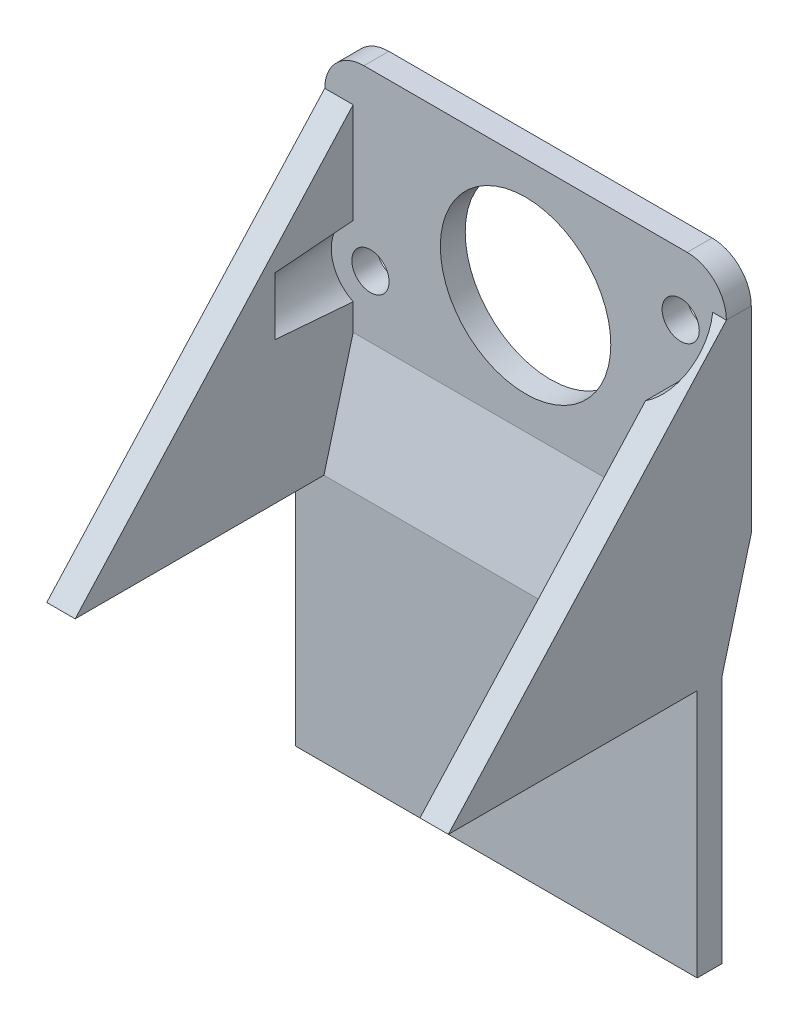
ISO-10303-21;
HEADER;
FILE_DESCRIPTION(('STEP AP214'),'2;1');
FILE_NAME('part.step','',(''),(''),'','','');
FILE_SCHEMA(('AUTOMOTIVE_DESIGN { 1 0 10303 214 1 1 1 1 }'));
ENDSEC;
DATA;
#1=APPLICATION_CONTEXT('core data for automotive mechanical design processes');
#2=APPLICATION_PROTOCOL_DEFINITION('international standard','automotive_design',2000,#1);
#3=PRODUCT_CONTEXT('',#1,'mechanical');
#4=PRODUCT('Part','Part','',(#3));
#5=PRODUCT_RELATED_PRODUCT_CATEGORY('part','',(#4));
#6=PRODUCT_DEFINITION_FORMATION('','',#4);
#7=PRODUCT_DEFINITION_CONTEXT('part definition',#1,'design');
#8=PRODUCT_DEFINITION('design','',#6,#7);
#9=PRODUCT_DEFINITION_SHAPE('','',#8);
#10=(LENGTH_UNIT() NAMED_UNIT(*) SI_UNIT(.MILLI.,.METRE.));
#11=(NAMED_UNIT(*) PLANE_ANGLE_UNIT() SI_UNIT($,.RADIAN.));
#12=(NAMED_UNIT(*) SI_UNIT($,.STERADIAN.) SOLID_ANGLE_UNIT());
#13=UNCERTAINTY_MEASURE_WITH_UNIT(LENGTH_MEASURE(1.E-05),#10,'distance_accuracy_value','');
#14=(GEOMETRIC_REPRESENTATION_CONTEXT(3) GLOBAL_UNCERTAINTY_ASSIGNED_CONTEXT((#13)) GLOBAL_UNIT_ASSIGNED_CONTEXT((#10,
#11,#12)) REPRESENTATION_CONTEXT('',''));
#15=CARTESIAN_POINT('',(0.,0.,0.));
#16=DIRECTION('',(0.,0.,1.));
#17=DIRECTION('',(1.,0.,0.));
#18=AXIS2_PLACEMENT_3D('',#15,#16,#17);
#19=CARTESIAN_POINT('',(-44.,0.,0.));
#20=DIRECTION('',(-1.,0.,0.));
#21=DIRECTION('',(0.,0.,1.));
#22=AXIS2_PLACEMENT_3D('',#19,#20,#21);
#23=PLANE('',#22);
#24=CARTESIAN_POINT('',(-44.,-19.3448213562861,54.6344712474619));
#25=CARTESIAN_POINT('',(-44.,-19.441196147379,53.6070138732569));
#26=CARTESIAN_POINT('',(-44.,-19.5363539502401,52.5794432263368));
#27=CARTESIAN_POINT('',(-44.,-19.7245603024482,50.5241100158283));
#28=CARTESIAN_POINT('',(-44.,-19.817608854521,49.4963474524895));
#29=CARTESIAN_POINT('',(-44.,-20.0940765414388,46.4128370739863));
#30=CARTESIAN_POINT('',(-44.,-20.2748193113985,44.356849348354));
#31=CARTESIAN_POINT('',(-44.,-20.6309239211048,40.2443890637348));
#32=CARTESIAN_POINT('',(-44.,-20.8062857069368,38.187916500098));
#33=CARTESIAN_POINT('',(-44.,-21.1528041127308,34.0746167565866));
#34=CARTESIAN_POINT('',(-44.,-21.3239607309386,32.0177895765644));
#35=CARTESIAN_POINT('',(-44.,-21.6629157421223,27.9038542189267));
#36=CARTESIAN_POINT('',(-44.,-21.8307141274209,25.8467460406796));
#37=CARTESIAN_POINT('',(-44.,-22.1635689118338,21.7323076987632));
#38=CARTESIAN_POINT('',(-44.,-22.3286253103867,19.6749775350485));
#39=CARTESIAN_POINT('',(-44.,-22.8204188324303,13.5026631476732));
#40=CARTESIAN_POINT('',(-44.,-23.1437758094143,9.38740965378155));
#41=CARTESIAN_POINT('',(-44.,-23.7840959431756,1.15641187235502));
#42=CARTESIAN_POINT('',(-44.,-24.1010591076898,-2.95933241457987));
#43=CARTESIAN_POINT('',(-44.,-24.6049101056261,-9.55168985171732));
#44=CARTESIAN_POINT('',(-44.,-24.7933193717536,-12.0281868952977));
#45=CARTESIAN_POINT('',(-44.,-25.1686559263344,-16.9812642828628));
#46=CARTESIAN_POINT('',(-44.,-25.3555832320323,-19.4578446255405));
#47=CARTESIAN_POINT('',(-44.,-25.5418940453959,-21.9344712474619));
#48=B_SPLINE_CURVE_WITH_KNOTS('',3,(#24,#25,#26,#27,#28,#29,#30,#31,#32,#33,#34,#35,#36,#37,#38,
#39,#40,#41,#42,#43,#44,#45,#46,#47),.UNSPECIFIED.,.F.,.F.,(4,2,2,2,2,2,2,2,2,2,2,4),(0.,
3.09590020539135,6.19179640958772,12.3835369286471,18.5753394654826,24.7671445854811,
30.9589638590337,37.1507844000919,49.5345899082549,61.9183804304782,69.3693410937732,
76.8202149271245),.UNSPECIFIED.);
#49=CARTESIAN_POINT('',(-44.,-21.7892646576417,26.35));
#50=VERTEX_POINT('',#49);
#51=CARTESIAN_POINT('',(-44.,-23.379990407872,6.35));
#52=VERTEX_POINT('',#51);
#53=EDGE_CURVE('E11',#50,#52,#48,.T.);
#54=ORIENTED_EDGE('',*,*,#53,.F.);
#55=DIRECTION('',(0.,1.,0.));
#56=VECTOR('',#55,1.);
#57=CARTESIAN_POINT('',(-44.,0.,26.35));
#58=LINE('',#57,#56);
#59=CARTESIAN_POINT('',(-44.,-7.02593241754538,26.35));
#60=VERTEX_POINT('',#59);
#61=EDGE_CURVE('E225',#50,#60,#58,.T.);
#62=ORIENTED_EDGE('',*,*,#61,.T.);
#63=CARTESIAN_POINT('',(-44.,-3.27330302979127,-21.9344712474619));
#64=CARTESIAN_POINT('',(-44.,-3.41328984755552,-20.0735885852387));
#65=CARTESIAN_POINT('',(-44.,-3.55362808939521,-18.2127323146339));
#66=CARTESIAN_POINT('',(-44.,-3.83510652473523,-14.4910824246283));
#67=CARTESIAN_POINT('',(-44.,-3.97624671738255,-12.630288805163));
#68=CARTESIAN_POINT('',(-44.,-4.25942751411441,-8.90878249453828));
#69=CARTESIAN_POINT('',(-44.,-4.4014681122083,-7.04806980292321));
#70=CARTESIAN_POINT('',(-44.,-4.68657362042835,-3.32672087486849));
#71=CARTESIAN_POINT('',(-44.,-4.82963853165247,-1.46608463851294));
#72=CARTESIAN_POINT('',(-44.,-5.14785299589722,2.65553022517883));
#73=CARTESIAN_POINT('',(-44.,-5.32328115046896,4.91648735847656));
#74=CARTESIAN_POINT('',(-44.,-5.67618536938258,9.43824168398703));
#75=CARTESIAN_POINT('',(-44.,-5.85366143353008,11.6990388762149));
#76=CARTESIAN_POINT('',(-44.,-6.2110751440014,16.2204318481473));
#77=CARTESIAN_POINT('',(-44.,-6.39101278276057,18.4810276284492));
#78=CARTESIAN_POINT('',(-44.,-6.75389127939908,23.0019796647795));
#79=CARTESIAN_POINT('',(-44.,-6.93683213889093,25.2623359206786));
#80=CARTESIAN_POINT('',(-44.,-7.30644801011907,29.7827852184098));
#81=CARTESIAN_POINT('',(-44.,-7.49312309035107,32.0428782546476));
#82=CARTESIAN_POINT('',(-44.,-7.87120034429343,36.5626667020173));
#83=CARTESIAN_POINT('',(-44.,-8.06260251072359,38.8223621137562));
#84=CARTESIAN_POINT('',(-44.,-8.35434771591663,42.2115195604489));
#85=CARTESIAN_POINT('',(-44.,-8.45237039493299,43.3411813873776));
#86=CARTESIAN_POINT('',(-44.,-8.65021678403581,45.6003469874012));
#87=CARTESIAN_POINT('',(-44.,-8.75004049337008,46.7298507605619));
#88=CARTESIAN_POINT('',(-44.,-8.95178559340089,48.988677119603));
#89=CARTESIAN_POINT('',(-44.,-9.05370699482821,50.1179997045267));
#90=CARTESIAN_POINT('',(-44.,-9.26005775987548,52.3764172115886));
#91=CARTESIAN_POINT('',(-44.,-9.36448712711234,53.5055121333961));
#92=CARTESIAN_POINT('',(-44.,-9.47037571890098,54.6344712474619));
#93=B_SPLINE_CURVE_WITH_KNOTS('',3,(#63,#64,#65,#66,#67,#68,#69,#70,#71,#72,#73,#74,#75,#76,#77,
#78,#79,#80,#81,#82,#83,#84,#85,#86,#87,#88,#89,#90,#91,#92),.UNSPECIFIED.,.F.,.F.,(4,2,2,2,2,2,
2,2,2,2,2,2,2,2,4),(0.,5.59842171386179,11.1968374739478,16.7952160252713,22.3936005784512,
29.1968578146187,36.0001144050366,42.8033500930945,49.6065894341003,56.4099536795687,
63.2133074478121,66.6150262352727,70.0167436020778,73.4184783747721,76.8202180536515),.UNSPECIFIED.);
#94=CARTESIAN_POINT('',(-44.,-5.43520666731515,6.35));
#95=VERTEX_POINT('',#94);
#96=EDGE_CURVE('E61',#95,#60,#93,.T.);
#97=ORIENTED_EDGE('',*,*,#96,.F.);
#98=DIRECTION('',(0.,1.,0.));
#99=VECTOR('',#98,1.);
#100=CARTESIAN_POINT('',(-44.,30.1625,6.35));
#101=LINE('',#100,#99);
#102=CARTESIAN_POINT('',(-44.,20.1625,6.35));
#103=VERTEX_POINT('',#102);
#104=EDGE_CURVE('E223',#95,#103,#101,.T.);
#105=ORIENTED_EDGE('',*,*,#104,.T.);
#106=DIRECTION('',(0.,0.74044352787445,-0.672118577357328));
#107=VECTOR('',#106,1.);
#108=CARTESIAN_POINT('',(-44.,-58.,77.3));
#109=LINE('',#108,#107);
#110=CARTESIAN_POINT('',(-44.,-58.,77.3));
#111=VERTEX_POINT('',#110);
#112=EDGE_CURVE('E474',#111,#103,#109,.T.);
#113=ORIENTED_EDGE('',*,*,#112,.F.);
#114=DIRECTION('',(0.,0.,-1.));
#115=VECTOR('',#114,1.);
#116=CARTESIAN_POINT('',(-44.,-58.,13.7999999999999));
#117=LINE('',#116,#115);
#118=CARTESIAN_POINT('',(-44.,-58.,13.7999999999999));
#119=VERTEX_POINT('',#118);
#120=EDGE_CURVE('E238',#111,#119,#117,.T.);
#121=ORIENTED_EDGE('',*,*,#120,.T.);
#122=DIRECTION('',(0.,0.96600416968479,-0.258526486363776));
#123=VECTOR('',#122,1.);
#124=CARTESIAN_POINT('',(-44.,-30.1625,6.35));
#125=LINE('',#124,#123);
#126=CARTESIAN_POINT('',(-44.,-30.1625,6.35));
#127=VERTEX_POINT('',#126);
#128=EDGE_CURVE('E246',#119,#127,#125,.T.);
#129=ORIENTED_EDGE('',*,*,#128,.T.);
#130=EDGE_CURVE('E233',#127,#52,#101,.T.);
#131=ORIENTED_EDGE('',*,*,#130,.T.);
#132=EDGE_LOOP('',(#54,#62,#97,#105,#113,#121,#129,#131));
#133=FACE_BOUND('',#132,.T.);
#134=ADVANCED_FACE('F46',(#133),#23,.F.);
#135=CARTESIAN_POINT('',(44.,0.,0.));
#136=DIRECTION('',(-1.,0.,0.));
#137=DIRECTION('',(0.,0.,1.));
#138=AXIS2_PLACEMENT_3D('',#135,#136,#137);
#139=PLANE('',#138);
#140=DIRECTION('',(0.,0.74044352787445,-0.672118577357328));
#141=VECTOR('',#140,1.);
#142=CARTESIAN_POINT('',(44.,-58.,77.3));
#143=LINE('',#142,#141);
#144=CARTESIAN_POINT('',(44.,-58.,77.3));
#145=VERTEX_POINT('',#144);
#146=CARTESIAN_POINT('',(44.,5.43520666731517,19.7183219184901));
#147=VERTEX_POINT('',#146);
#148=EDGE_CURVE('E471',#145,#147,#143,.T.);
#149=ORIENTED_EDGE('',*,*,#148,.T.);
#150=DIRECTION('',(0.,0.,-1.));
#151=VECTOR('',#150,1.);
#152=CARTESIAN_POINT('',(44.,5.43520666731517,44.8155460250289));
#153=LINE('',#152,#151);
#154=CARTESIAN_POINT('',(44.,5.43520666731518,6.35));
#155=VERTEX_POINT('',#154);
#156=EDGE_CURVE('E477',#147,#155,#153,.T.);
#157=ORIENTED_EDGE('',*,*,#156,.T.);
#158=DIRECTION('',(0.,1.,0.));
#159=VECTOR('',#158,1.);
#160=CARTESIAN_POINT('',(44.,30.1625,6.35));
#161=LINE('',#160,#159);
#162=CARTESIAN_POINT('',(44.,-30.1625,6.35));
#163=VERTEX_POINT('',#162);
#164=EDGE_CURVE('E251',#163,#155,#161,.T.);
#165=ORIENTED_EDGE('',*,*,#164,.F.);
#166=DIRECTION('',(0.,0.96600416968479,-0.258526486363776));
#167=VECTOR('',#166,1.);
#168=CARTESIAN_POINT('',(44.,-30.1625,6.35));
#169=LINE('',#168,#167);
#170=CARTESIAN_POINT('',(44.,-58.,13.7999999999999));
#171=VERTEX_POINT('',#170);
#172=EDGE_CURVE('E234',#171,#163,#169,.T.);
#173=ORIENTED_EDGE('',*,*,#172,.F.);
#174=DIRECTION('',(0.,0.,-1.));
#175=VECTOR('',#174,1.);
#176=CARTESIAN_POINT('',(44.,-58.,13.7999999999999));
#177=LINE('',#176,#175);
#178=EDGE_CURVE('E76',#145,#171,#177,.T.);
#179=ORIENTED_EDGE('',*,*,#178,.F.);
#180=EDGE_LOOP('',(#149,#157,#165,#173,#179));
#181=FACE_BOUND('',#180,.T.);
#182=ADVANCED_FACE('F503',(#181),#139,.T.);
#183=CARTESIAN_POINT('',(51.25,-58.,77.3));
#184=DIRECTION('',(0.,1.,0.));
#185=DIRECTION('',(0.,0.,1.));
#186=AXIS2_PLACEMENT_3D('',#183,#184,#185);
#187=PLANE('',#186);
#188=ORIENTED_EDGE('',*,*,#178,.T.);
#189=DIRECTION('',(-1.,0.,0.));
#190=VECTOR('',#189,1.);
#191=CARTESIAN_POINT('',(51.25,-58.,13.7999999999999));
#192=LINE('',#191,#190);
#193=CARTESIAN_POINT('',(51.25,-58.,13.7999999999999));
#194=VERTEX_POINT('',#193);
#195=EDGE_CURVE('E403',#194,#171,#192,.T.);
#196=ORIENTED_EDGE('',*,*,#195,.F.);
#197=DIRECTION('',(0.,0.,-1.));
#198=VECTOR('',#197,1.);
#199=CARTESIAN_POINT('',(51.25,-58.,77.3));
#200=LINE('',#199,#198);
#201=CARTESIAN_POINT('',(51.25,-58.,77.3));
#202=VERTEX_POINT('',#201);
#203=EDGE_CURVE('E267',#202,#194,#200,.T.);
#204=ORIENTED_EDGE('',*,*,#203,.F.);
#205=DIRECTION('',(-1.,0.,0.));
#206=VECTOR('',#205,1.);
#207=CARTESIAN_POINT('',(51.25,-58.,77.3));
#208=LINE('',#207,#206);
#209=EDGE_CURVE('E278',#202,#145,#208,.T.);
#210=ORIENTED_EDGE('',*,*,#209,.T.);
#211=EDGE_LOOP('',(#188,#196,#204,#210));
#212=FACE_BOUND('',#211,.T.);
#213=ADVANCED_FACE('F507',(#212),#187,.F.);
#214=CARTESIAN_POINT('',(51.25,-58.,77.3));
#215=DIRECTION('',(0.,-0.672118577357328,-0.74044352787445));
#216=DIRECTION('',(0.,0.74044352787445,-0.672118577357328));
#217=AXIS2_PLACEMENT_3D('',#214,#215,#216);
#218=PLANE('',#217);
#219=CARTESIAN_POINT('',(39.5845516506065,14.4075985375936,11.5738638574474));
#220=DIRECTION('',(0.,-0.672118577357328,-0.74044352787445));
#221=DIRECTION('',(0.,0.74044352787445,-0.672118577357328));
#222=AXIS2_PLACEMENT_3D('',#219,#220,#221);
#223=ELLIPSE('',#222,13.5054188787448,10.);
#224=CARTESIAN_POINT('',(47.7626387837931,20.1625,6.35));
#225=VERTEX_POINT('',#224);
#226=EDGE_CURVE('E255',#225,#147,#223,.T.);
#227=ORIENTED_EDGE('',*,*,#226,.T.);
#228=ORIENTED_EDGE('',*,*,#148,.F.);
#229=ORIENTED_EDGE('',*,*,#209,.F.);
#230=DIRECTION('',(0.,-0.74044352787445,0.672118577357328));
#231=VECTOR('',#230,1.);
#232=CARTESIAN_POINT('',(51.25,-58.,77.3));
#233=LINE('',#232,#231);
#234=CARTESIAN_POINT('',(51.25,20.1625,6.35));
#235=VERTEX_POINT('',#234);
#236=EDGE_CURVE('E264',#235,#202,#233,.T.);
#237=ORIENTED_EDGE('',*,*,#236,.F.);
#238=DIRECTION('',(-1.,0.,0.));
#239=VECTOR('',#238,1.);
#240=CARTESIAN_POINT('',(51.25,20.1625,6.35));
#241=LINE('',#240,#239);
#242=EDGE_CURVE('E282',#235,#225,#241,.T.);
#243=ORIENTED_EDGE('',*,*,#242,.T.);
#244=EDGE_LOOP('',(#227,#228,#229,#237,#243));
#245=FACE_BOUND('',#244,.T.);
#246=ADVANCED_FACE('F511',(#245),#218,.F.);
#247=CARTESIAN_POINT('',(0.,0.,6.35));
#248=DIRECTION('',(0.,0.,1.));
#249=DIRECTION('',(1.,0.,0.));
#250=AXIS2_PLACEMENT_3D('',#247,#248,#249);
#251=PLANE('',#250);
#252=CARTESIAN_POINT('',(39.5845516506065,14.4075985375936,6.35));
#253=DIRECTION('',(0.,0.,1.));
#254=DIRECTION('',(1.,0.,0.));
#255=AXIS2_PLACEMENT_3D('',#252,#253,#254);
#256=CIRCLE('',#255,4.75);
#257=CARTESIAN_POINT('',(44.3345516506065,14.4075985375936,6.35));
#258=VERTEX_POINT('',#257);
#259=EDGE_CURVE('E290',#258,#258,#256,.T.);
#260=ORIENTED_EDGE('',*,*,#259,.F.);
#261=EDGE_LOOP('',(#260));
#262=FACE_BOUND('',#261,.T.);
#263=ORIENTED_EDGE('',*,*,#104,.F.);
#264=CARTESIAN_POINT('',(-39.5845516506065,-14.4075985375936,6.35));
#265=DIRECTION('',(0.,0.,1.));
#266=DIRECTION('',(1.,0.,0.));
#267=AXIS2_PLACEMENT_3D('',#264,#265,#266);
#268=CIRCLE('',#267,10.);
#269=EDGE_CURVE('E208',#95,#52,#268,.T.);
#270=ORIENTED_EDGE('',*,*,#269,.T.);
#271=ORIENTED_EDGE('',*,*,#130,.F.);
#272=DIRECTION('',(1.,0.,0.));
#273=VECTOR('',#272,1.);
#274=CARTESIAN_POINT('',(-44.,-30.1625,6.35));
#275=LINE('',#274,#273);
#276=EDGE_CURVE('E258',#127,#163,#275,.T.);
#277=ORIENTED_EDGE('',*,*,#276,.T.);
#278=ORIENTED_EDGE('',*,*,#164,.T.);
#279=CARTESIAN_POINT('',(39.5845516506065,14.4075985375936,6.35));
#280=DIRECTION('',(0.,0.,1.));
#281=DIRECTION('',(1.,0.,0.));
#282=AXIS2_PLACEMENT_3D('',#279,#280,#281);
#283=CIRCLE('',#282,10.);
#284=EDGE_CURVE('E68',#155,#225,#283,.T.);
#285=ORIENTED_EDGE('',*,*,#284,.T.);
#286=ORIENTED_EDGE('',*,*,#242,.F.);
#287=CARTESIAN_POINT('',(41.25,20.1625,6.35));
#288=DIRECTION('',(0.,0.,1.));
#289=DIRECTION('',(1.,0.,0.));
#290=AXIS2_PLACEMENT_3D('',#287,#288,#289);
#291=CIRCLE('',#290,10.);
#292=CARTESIAN_POINT('',(41.25,30.1625,6.35));
#293=VERTEX_POINT('',#292);
#294=EDGE_CURVE('E461',#235,#293,#291,.T.);
#295=ORIENTED_EDGE('',*,*,#294,.T.);
#296=DIRECTION('',(-1.,0.,0.));
#297=VECTOR('',#296,1.);
#298=CARTESIAN_POINT('',(-51.25,30.1625,6.35));
#299=LINE('',#298,#297);
#300=CARTESIAN_POINT('',(-41.25,30.1625,6.35));
#301=VERTEX_POINT('',#300);
#302=EDGE_CURVE('E424',#293,#301,#299,.T.);
#303=ORIENTED_EDGE('',*,*,#302,.T.);
#304=CARTESIAN_POINT('',(-41.25,20.1625,6.35));
#305=DIRECTION('',(0.,0.,1.));
#306=DIRECTION('',(1.,0.,0.));
#307=AXIS2_PLACEMENT_3D('',#304,#305,#306);
#308=CIRCLE('',#307,10.);
#309=CARTESIAN_POINT('',(-51.25,20.1625,6.35));
#310=VERTEX_POINT('',#309);
#311=EDGE_CURVE('E464',#301,#310,#308,.T.);
#312=ORIENTED_EDGE('',*,*,#311,.T.);
#313=EDGE_CURVE('E231',#103,#310,#241,.T.);
#314=ORIENTED_EDGE('',*,*,#313,.F.);
#315=EDGE_LOOP('',(#263,#270,#271,#277,#278,#285,#286,#295,#303,#312,#314));
#316=FACE_BOUND('',#315,.T.);
#317=CARTESIAN_POINT('',(0.,0.,6.35));
#318=DIRECTION('',(0.,0.,1.));
#319=DIRECTION('',(1.,0.,0.));
#320=AXIS2_PLACEMENT_3D('',#317,#318,#319);
#321=CIRCLE('',#320,21.75);
#322=CARTESIAN_POINT('',(21.75,0.,6.35));
#323=VERTEX_POINT('',#322);
#324=EDGE_CURVE('E416',#323,#323,#321,.T.);
#325=ORIENTED_EDGE('',*,*,#324,.F.);
#326=EDGE_LOOP('',(#325));
#327=FACE_BOUND('',#326,.T.);
#328=CARTESIAN_POINT('',(-39.5845516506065,-14.4075985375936,6.35));
#329=DIRECTION('',(0.,0.,1.));
#330=DIRECTION('',(1.,0.,0.));
#331=AXIS2_PLACEMENT_3D('',#328,#329,#330);
#332=CIRCLE('',#331,4.75);
#333=CARTESIAN_POINT('',(-34.8345516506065,-14.4075985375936,6.35));
#334=VERTEX_POINT('',#333);
#335=EDGE_CURVE('E286',#334,#334,#332,.T.);
#336=ORIENTED_EDGE('',*,*,#335,.F.);
#337=EDGE_LOOP('',(#336));
#338=FACE_BOUND('',#337,.T.);
#339=ADVANCED_FACE('F228',(#262,#316,#327,#338),#251,.T.);
#340=CARTESIAN_POINT('',(40.,-121.5,7.44999999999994));
#341=DIRECTION('',(0.,0.0812956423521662,0.996690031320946));
#342=DIRECTION('',(0.,-0.996690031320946,0.0812956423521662));
#343=AXIS2_PLACEMENT_3D('',#340,#341,#342);
#344=PLANE('',#343);
#345=DIRECTION('',(0.,-0.996690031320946,0.0812956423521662));
#346=VECTOR('',#345,1.);
#347=CARTESIAN_POINT('',(32.5,-121.5,7.44999999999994));
#348=LINE('',#347,#346);
#349=CARTESIAN_POINT('',(32.5,-30.1625,0.));
#350=VERTEX_POINT('',#349);
#351=CARTESIAN_POINT('',(32.5,-121.5,7.44999999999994));
#352=VERTEX_POINT('',#351);
#353=EDGE_CURVE('E304',#350,#352,#348,.T.);
#354=ORIENTED_EDGE('',*,*,#353,.F.);
#355=DIRECTION('',(-1.,0.,0.));
#356=VECTOR('',#355,1.);
#357=CARTESIAN_POINT('',(40.,-30.1625,0.));
#358=LINE('',#357,#356);
#359=CARTESIAN_POINT('',(40.,-30.1625,0.));
#360=VERTEX_POINT('',#359);
#361=EDGE_CURVE('E351',#360,#350,#358,.T.);
#362=ORIENTED_EDGE('',*,*,#361,.F.);
#363=DIRECTION('',(0.,0.996690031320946,-0.0812956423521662));
#364=VECTOR('',#363,1.);
#365=CARTESIAN_POINT('',(40.,-121.5,7.44999999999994));
#366=LINE('',#365,#364);
#367=CARTESIAN_POINT('',(40.,-121.5,7.44999999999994));
#368=VERTEX_POINT('',#367);
#369=EDGE_CURVE('E333',#368,#360,#366,.T.);
#370=ORIENTED_EDGE('',*,*,#369,.F.);
#371=DIRECTION('',(-1.,0.,0.));
#372=VECTOR('',#371,1.);
#373=CARTESIAN_POINT('',(40.,-121.5,7.44999999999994));
#374=LINE('',#373,#372);
#375=EDGE_CURVE('E356',#368,#352,#374,.T.);
#376=ORIENTED_EDGE('',*,*,#375,.T.);
#377=EDGE_LOOP('',(#354,#362,#370,#376));
#378=FACE_BOUND('',#377,.T.);
#379=ADVANCED_FACE('F550',(#378),#344,.F.);
#380=CARTESIAN_POINT('',(51.25,-58.,7.44999999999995));
#381=DIRECTION('',(0.,0.,1.));
#382=DIRECTION('',(0.,-1.,0.));
#383=AXIS2_PLACEMENT_3D('',#380,#381,#382);
#384=PLANE('',#383);
#385=DIRECTION('',(0.,-1.,0.));
#386=VECTOR('',#385,1.);
#387=CARTESIAN_POINT('',(40.,-58.,7.44999999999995));
#388=LINE('',#387,#386);
#389=CARTESIAN_POINT('',(40.,-58.,7.44999999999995));
#390=VERTEX_POINT('',#389);
#391=EDGE_CURVE('E329',#390,#368,#388,.T.);
#392=ORIENTED_EDGE('',*,*,#391,.F.);
#393=DIRECTION('',(-1.,0.,0.));
#394=VECTOR('',#393,1.);
#395=CARTESIAN_POINT('',(51.25,-58.,7.44999999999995));
#396=LINE('',#395,#394);
#397=CARTESIAN_POINT('',(51.25,-58.,7.44999999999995));
#398=VERTEX_POINT('',#397);
#399=EDGE_CURVE('E389',#398,#390,#396,.T.);
#400=ORIENTED_EDGE('',*,*,#399,.F.);
#401=DIRECTION('',(0.,1.,0.));
#402=VECTOR('',#401,1.);
#403=CARTESIAN_POINT('',(51.25,-58.,7.44999999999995));
#404=LINE('',#403,#402);
#405=CARTESIAN_POINT('',(51.25,-121.5,7.44999999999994));
#406=VERTEX_POINT('',#405);
#407=EDGE_CURVE('E368',#406,#398,#404,.T.);
#408=ORIENTED_EDGE('',*,*,#407,.F.);
#409=DIRECTION('',(-1.,0.,0.));
#410=VECTOR('',#409,1.);
#411=CARTESIAN_POINT('',(51.25,-121.5,7.44999999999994));
#412=LINE('',#411,#410);
#413=EDGE_CURVE('E394',#406,#368,#412,.T.);
#414=ORIENTED_EDGE('',*,*,#413,.T.);
#415=EDGE_LOOP('',(#392,#400,#408,#414));
#416=FACE_BOUND('',#415,.T.);
#417=ADVANCED_FACE('F560',(#416),#384,.F.);
#418=CARTESIAN_POINT('',(51.25,-30.1625,0.));
#419=DIRECTION('',(0.,0.258526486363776,0.96600416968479));
#420=DIRECTION('',(0.,-0.96600416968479,0.258526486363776));
#421=AXIS2_PLACEMENT_3D('',#418,#419,#420);
#422=PLANE('',#421);
#423=DIRECTION('',(0.,-0.96600416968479,0.258526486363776));
#424=VECTOR('',#423,1.);
#425=CARTESIAN_POINT('',(40.,-30.1625,0.));
#426=LINE('',#425,#424);
#427=EDGE_CURVE('E337',#360,#390,#426,.T.);
#428=ORIENTED_EDGE('',*,*,#427,.F.);
#429=DIRECTION('',(1.,0.,0.));
#430=VECTOR('',#429,1.);
#431=CARTESIAN_POINT('',(-51.25,-30.1625,0.));
#432=LINE('',#431,#430);
#433=CARTESIAN_POINT('',(51.25,-30.1625,0.));
#434=VERTEX_POINT('',#433);
#435=EDGE_CURVE('E437',#360,#434,#432,.T.);
#436=ORIENTED_EDGE('',*,*,#435,.T.);
#437=DIRECTION('',(0.,0.96600416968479,-0.258526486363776));
#438=VECTOR('',#437,1.);
#439=CARTESIAN_POINT('',(51.25,-30.1625,0.));
#440=LINE('',#439,#438);
#441=EDGE_CURVE('E371',#398,#434,#440,.T.);
#442=ORIENTED_EDGE('',*,*,#441,.F.);
#443=ORIENTED_EDGE('',*,*,#399,.T.);
#444=EDGE_LOOP('',(#428,#436,#442,#443));
#445=FACE_BOUND('',#444,.T.);
#446=ADVANCED_FACE('F555',(#445),#422,.F.);
#447=CARTESIAN_POINT('',(0.,0.,0.));
#448=DIRECTION('',(0.,0.,1.));
#449=DIRECTION('',(1.,0.,0.));
#450=AXIS2_PLACEMENT_3D('',#447,#448,#449);
#451=PLANE('',#450);
#452=CARTESIAN_POINT('',(-39.5845516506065,-14.4075985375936,0.));
#453=DIRECTION('',(0.,0.,1.));
#454=DIRECTION('',(1.,0.,0.));
#455=AXIS2_PLACEMENT_3D('',#452,#453,#454);
#456=CIRCLE('',#455,4.75);
#457=CARTESIAN_POINT('',(-34.8345516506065,-14.4075985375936,0.));
#458=VERTEX_POINT('',#457);
#459=EDGE_CURVE('E408',#458,#458,#456,.T.);
#460=ORIENTED_EDGE('',*,*,#459,.T.);
#461=EDGE_LOOP('',(#460));
#462=FACE_BOUND('',#461,.T.);
#463=CARTESIAN_POINT('',(39.5845516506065,14.4075985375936,0.));
#464=DIRECTION('',(0.,0.,1.));
#465=DIRECTION('',(1.,0.,0.));
#466=AXIS2_PLACEMENT_3D('',#463,#464,#465);
#467=CIRCLE('',#466,4.75);
#468=CARTESIAN_POINT('',(44.3345516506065,14.4075985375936,0.));
#469=VERTEX_POINT('',#468);
#470=EDGE_CURVE('E407',#469,#469,#467,.T.);
#471=ORIENTED_EDGE('',*,*,#470,.T.);
#472=EDGE_LOOP('',(#471));
#473=FACE_BOUND('',#472,.T.);
#474=DIRECTION('',(0.,-1.,0.));
#475=VECTOR('',#474,1.);
#476=CARTESIAN_POINT('',(-51.25,-30.1625,0.));
#477=LINE('',#476,#475);
#478=CARTESIAN_POINT('',(-51.25,20.1625,0.));
#479=VERTEX_POINT('',#478);
#480=CARTESIAN_POINT('',(-51.25,-30.1625,0.));
#481=VERTEX_POINT('',#480);
#482=EDGE_CURVE('E433',#479,#481,#477,.T.);
#483=ORIENTED_EDGE('',*,*,#482,.F.);
#484=CARTESIAN_POINT('',(-41.25,20.1625,0.));
#485=DIRECTION('',(0.,0.,1.));
#486=DIRECTION('',(1.,0.,0.));
#487=AXIS2_PLACEMENT_3D('',#484,#485,#486);
#488=CIRCLE('',#487,10.);
#489=CARTESIAN_POINT('',(-41.25,30.1625,0.));
#490=VERTEX_POINT('',#489);
#491=EDGE_CURVE('E451',#479,#490,#488,.F.);
#492=ORIENTED_EDGE('',*,*,#491,.T.);
#493=DIRECTION('',(-1.,0.,0.));
#494=VECTOR('',#493,1.);
#495=CARTESIAN_POINT('',(-51.25,30.1625,0.));
#496=LINE('',#495,#494);
#497=CARTESIAN_POINT('',(41.25,30.1625,0.));
#498=VERTEX_POINT('',#497);
#499=EDGE_CURVE('E420',#498,#490,#496,.T.);
#500=ORIENTED_EDGE('',*,*,#499,.F.);
#501=CARTESIAN_POINT('',(41.25,20.1625,0.));
#502=DIRECTION('',(0.,0.,1.));
#503=DIRECTION('',(1.,0.,0.));
#504=AXIS2_PLACEMENT_3D('',#501,#502,#503);
#505=CIRCLE('',#504,10.);
#506=CARTESIAN_POINT('',(51.25,20.1625,0.));
#507=VERTEX_POINT('',#506);
#508=EDGE_CURVE('E448',#498,#507,#505,.F.);
#509=ORIENTED_EDGE('',*,*,#508,.T.);
#510=DIRECTION('',(0.,1.,0.));
#511=VECTOR('',#510,1.);
#512=CARTESIAN_POINT('',(51.25,-30.1625,0.));
#513=LINE('',#512,#511);
#514=EDGE_CURVE('E429',#434,#507,#513,.T.);
#515=ORIENTED_EDGE('',*,*,#514,.F.);
#516=ORIENTED_EDGE('',*,*,#435,.F.);
#517=ORIENTED_EDGE('',*,*,#361,.T.);
#518=DIRECTION('',(-1.,0.,0.));
#519=VECTOR('',#518,1.);
#520=CARTESIAN_POINT('',(32.5,-30.1625,0.));
#521=LINE('',#520,#519);
#522=CARTESIAN_POINT('',(-32.5,-30.1625,0.));
#523=VERTEX_POINT('',#522);
#524=EDGE_CURVE('E323',#350,#523,#521,.T.);
#525=ORIENTED_EDGE('',*,*,#524,.T.);
#526=CARTESIAN_POINT('',(-40.,-30.1625,0.));
#527=VERTEX_POINT('',#526);
#528=EDGE_CURVE('E340',#523,#527,#358,.T.);
#529=ORIENTED_EDGE('',*,*,#528,.T.);
#530=EDGE_CURVE('E438',#481,#527,#432,.T.);
#531=ORIENTED_EDGE('',*,*,#530,.F.);
#532=EDGE_LOOP('',(#483,#492,#500,#509,#515,#516,#517,#525,#529,#531));
#533=FACE_BOUND('',#532,.T.);
#534=CARTESIAN_POINT('',(0.,0.,0.));
#535=DIRECTION('',(0.,0.,1.));
#536=DIRECTION('',(1.,0.,0.));
#537=AXIS2_PLACEMENT_3D('',#534,#535,#536);
#538=CIRCLE('',#537,21.75);
#539=CARTESIAN_POINT('',(21.75,0.,0.));
#540=VERTEX_POINT('',#539);
#541=EDGE_CURVE('E412',#540,#540,#538,.T.);
#542=ORIENTED_EDGE('',*,*,#541,.T.);
#543=EDGE_LOOP('',(#542));
#544=FACE_BOUND('',#543,.T.);
#545=ADVANCED_FACE('F585',(#462,#473,#533,#544),#451,.F.);
#546=CARTESIAN_POINT('',(-51.25,30.1625,6.35));
#547=DIRECTION('',(0.,-1.,0.));
#548=DIRECTION('',(0.,0.,-1.));
#549=AXIS2_PLACEMENT_3D('',#546,#547,#548);
#550=PLANE('',#549);
#551=ORIENTED_EDGE('',*,*,#499,.T.);
#552=DIRECTION('',(0.,0.,-1.));
#553=VECTOR('',#552,1.);
#554=CARTESIAN_POINT('',(-41.25,30.1625,6.35));
#555=LINE('',#554,#553);
#556=EDGE_CURVE('E458',#490,#301,#555,.F.);
#557=ORIENTED_EDGE('',*,*,#556,.T.);
#558=ORIENTED_EDGE('',*,*,#302,.F.);
#559=DIRECTION('',(0.,0.,-1.));
#560=VECTOR('',#559,1.);
#561=CARTESIAN_POINT('',(41.25,30.1625,6.35));
#562=LINE('',#561,#560);
#563=EDGE_CURVE('E454',#293,#498,#562,.T.);
#564=ORIENTED_EDGE('',*,*,#563,.T.);
#565=EDGE_LOOP('',(#551,#557,#558,#564));
#566=FACE_BOUND('',#565,.T.);
#567=ADVANCED_FACE('F588',(#566),#550,.F.);
#568=CARTESIAN_POINT('',(-51.25,-30.1625,6.35));
#569=DIRECTION('',(1.,0.,0.));
#570=DIRECTION('',(0.,0.,-1.));
#571=AXIS2_PLACEMENT_3D('',#568,#569,#570);
#572=PLANE('',#571);
#573=DIRECTION('',(0.,-0.74044352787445,0.672118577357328));
#574=VECTOR('',#573,1.);
#575=CARTESIAN_POINT('',(-51.25,-58.,77.3));
#576=LINE('',#575,#574);
#577=CARTESIAN_POINT('',(-51.25,-58.,77.3));
#578=VERTEX_POINT('',#577);
#579=EDGE_CURVE('E261',#310,#578,#576,.T.);
#580=ORIENTED_EDGE('',*,*,#579,.F.);
#581=DIRECTION('',(0.,0.,-1.));
#582=VECTOR('',#581,1.);
#583=CARTESIAN_POINT('',(-51.25,20.1625,6.35));
#584=LINE('',#583,#582);
#585=EDGE_CURVE('E428',#310,#479,#584,.T.);
#586=ORIENTED_EDGE('',*,*,#585,.T.);
#587=ORIENTED_EDGE('',*,*,#482,.T.);
#588=DIRECTION('',(0.,0.96600416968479,-0.258526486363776));
#589=VECTOR('',#588,1.);
#590=CARTESIAN_POINT('',(-51.25,-30.1625,0.));
#591=LINE('',#590,#589);
#592=CARTESIAN_POINT('',(-51.25,-58.,7.44999999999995));
#593=VERTEX_POINT('',#592);
#594=EDGE_CURVE('E365',#593,#481,#591,.T.);
#595=ORIENTED_EDGE('',*,*,#594,.F.);
#596=DIRECTION('',(0.,1.,0.));
#597=VECTOR('',#596,1.);
#598=CARTESIAN_POINT('',(-51.25,-58.,7.44999999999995));
#599=LINE('',#598,#597);
#600=CARTESIAN_POINT('',(-51.25,-121.5,7.44999999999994));
#601=VERTEX_POINT('',#600);
#602=EDGE_CURVE('E382',#601,#593,#599,.T.);
#603=ORIENTED_EDGE('',*,*,#602,.F.);
#604=DIRECTION('',(0.,0.,-1.));
#605=VECTOR('',#604,1.);
#606=CARTESIAN_POINT('',(-51.25,-121.5,7.44999999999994));
#607=LINE('',#606,#605);
#608=CARTESIAN_POINT('',(-51.25,-121.5,13.7999999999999));
#609=VERTEX_POINT('',#608);
#610=EDGE_CURVE('E378',#609,#601,#607,.T.);
#611=ORIENTED_EDGE('',*,*,#610,.F.);
#612=DIRECTION('',(0.,-1.,0.));
#613=VECTOR('',#612,1.);
#614=CARTESIAN_POINT('',(-51.25,-121.5,13.7999999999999));
#615=LINE('',#614,#613);
#616=CARTESIAN_POINT('',(-51.25,-58.,13.7999999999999));
#617=VERTEX_POINT('',#616);
#618=EDGE_CURVE('E360',#617,#609,#615,.T.);
#619=ORIENTED_EDGE('',*,*,#618,.F.);
#620=DIRECTION('',(0.,0.,-1.));
#621=VECTOR('',#620,1.);
#622=CARTESIAN_POINT('',(-51.25,-58.,77.3));
#623=LINE('',#622,#621);
#624=EDGE_CURVE('E268',#578,#617,#623,.T.);
#625=ORIENTED_EDGE('',*,*,#624,.F.);
#626=EDGE_LOOP('',(#580,#586,#587,#595,#603,#611,#619,#625));
#627=FACE_BOUND('',#626,.T.);
#628=ADVANCED_FACE('F592',(#627),#572,.F.);
#629=CARTESIAN_POINT('',(51.25,-30.1625,6.35));
#630=DIRECTION('',(-1.,0.,0.));
#631=DIRECTION('',(0.,0.,1.));
#632=AXIS2_PLACEMENT_3D('',#629,#630,#631);
#633=PLANE('',#632);
#634=DIRECTION('',(0.,0.,-1.));
#635=VECTOR('',#634,1.);
#636=CARTESIAN_POINT('',(51.25,20.1625,6.35));
#637=LINE('',#636,#635);
#638=EDGE_CURVE('E467',#507,#235,#637,.F.);
#639=ORIENTED_EDGE('',*,*,#638,.T.);
#640=ORIENTED_EDGE('',*,*,#236,.T.);
#641=ORIENTED_EDGE('',*,*,#203,.T.);
#642=DIRECTION('',(0.,-1.,0.));
#643=VECTOR('',#642,1.);
#644=CARTESIAN_POINT('',(51.25,-121.5,13.7999999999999));
#645=LINE('',#644,#643);
#646=CARTESIAN_POINT('',(51.25,-121.5,13.7999999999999));
#647=VERTEX_POINT('',#646);
#648=EDGE_CURVE('E361',#194,#647,#645,.T.);
#649=ORIENTED_EDGE('',*,*,#648,.T.);
#650=DIRECTION('',(0.,0.,-1.));
#651=VECTOR('',#650,1.);
#652=CARTESIAN_POINT('',(51.25,-121.5,7.44999999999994));
#653=LINE('',#652,#651);
#654=EDGE_CURVE('E364',#647,#406,#653,.T.);
#655=ORIENTED_EDGE('',*,*,#654,.T.);
#656=ORIENTED_EDGE('',*,*,#407,.T.);
#657=ORIENTED_EDGE('',*,*,#441,.T.);
#658=ORIENTED_EDGE('',*,*,#514,.T.);
#659=EDGE_LOOP('',(#639,#640,#641,#649,#655,#656,#657,#658));
#660=FACE_BOUND('',#659,.T.);
#661=ADVANCED_FACE('F580',(#660),#633,.F.);
#662=CARTESIAN_POINT('',(0.,0.,6.35));
#663=DIRECTION('',(0.,0.,-1.));
#664=DIRECTION('',(-1.,0.,0.));
#665=AXIS2_PLACEMENT_3D('',#662,#663,#664);
#666=CYLINDRICAL_SURFACE('',#665,21.75);
#667=ORIENTED_EDGE('',*,*,#324,.T.);
#668=EDGE_LOOP('',(#667));
#669=FACE_BOUND('',#668,.T.);
#670=ORIENTED_EDGE('',*,*,#541,.F.);
#671=EDGE_LOOP('',(#670));
#672=FACE_BOUND('',#671,.T.);
#673=ADVANCED_FACE('F576',(#669,#672),#666,.F.);
#674=CARTESIAN_POINT('',(-41.25,20.1625,6.35));
#675=DIRECTION('',(0.,0.,-1.));
#676=DIRECTION('',(-1.,0.,0.));
#677=AXIS2_PLACEMENT_3D('',#674,#675,#676);
#678=CYLINDRICAL_SURFACE('',#677,10.);
#679=ORIENTED_EDGE('',*,*,#311,.F.);
#680=ORIENTED_EDGE('',*,*,#556,.F.);
#681=ORIENTED_EDGE('',*,*,#491,.F.);
#682=ORIENTED_EDGE('',*,*,#585,.F.);
#683=EDGE_LOOP('',(#679,#680,#681,#682));
#684=FACE_BOUND('',#683,.T.);
#685=ADVANCED_FACE('F579',(#684),#678,.T.);
#686=CARTESIAN_POINT('',(41.25,20.1625,6.35));
#687=DIRECTION('',(0.,0.,-1.));
#688=DIRECTION('',(-1.,0.,0.));
#689=AXIS2_PLACEMENT_3D('',#686,#687,#688);
#690=CYLINDRICAL_SURFACE('',#689,10.);
#691=ORIENTED_EDGE('',*,*,#294,.F.);
#692=ORIENTED_EDGE('',*,*,#638,.F.);
#693=ORIENTED_EDGE('',*,*,#508,.F.);
#694=ORIENTED_EDGE('',*,*,#563,.F.);
#695=EDGE_LOOP('',(#691,#692,#693,#694));
#696=FACE_BOUND('',#695,.T.);
#697=ADVANCED_FACE('F48',(#696),#690,.T.);
#698=CARTESIAN_POINT('',(39.5845516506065,14.4075985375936,19.7850288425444));
#699=DIRECTION('',(0.,0.,-1.));
#700=DIRECTION('',(-1.,0.,0.));
#701=AXIS2_PLACEMENT_3D('',#698,#699,#700);
#702=CYLINDRICAL_SURFACE('',#701,4.75);
#703=ORIENTED_EDGE('',*,*,#470,.F.);
#704=EDGE_LOOP('',(#703));
#705=FACE_BOUND('',#704,.T.);
#706=ORIENTED_EDGE('',*,*,#259,.T.);
#707=EDGE_LOOP('',(#706));
#708=FACE_BOUND('',#707,.T.);
#709=ADVANCED_FACE('F571',(#705,#708),#702,.F.);
#710=CARTESIAN_POINT('',(-39.5845516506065,-14.4075985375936,19.7850288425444));
#711=DIRECTION('',(0.,0.,-1.));
#712=DIRECTION('',(-1.,0.,0.));
#713=AXIS2_PLACEMENT_3D('',#710,#711,#712);
#714=CYLINDRICAL_SURFACE('',#713,4.75);
#715=ORIENTED_EDGE('',*,*,#459,.F.);
#716=EDGE_LOOP('',(#715));
#717=FACE_BOUND('',#716,.T.);
#718=ORIENTED_EDGE('',*,*,#335,.T.);
#719=EDGE_LOOP('',(#718));
#720=FACE_BOUND('',#719,.T.);
#721=ADVANCED_FACE('F567',(#717,#720),#714,.F.);
#722=CARTESIAN_POINT('',(51.25,-121.5,13.7999999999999));
#723=DIRECTION('',(0.,0.,-1.));
#724=DIRECTION('',(-1.,0.,0.));
#725=AXIS2_PLACEMENT_3D('',#722,#723,#724);
#726=PLANE('',#725);
#727=ORIENTED_EDGE('',*,*,#618,.T.);
#728=DIRECTION('',(-1.,0.,0.));
#729=VECTOR('',#728,1.);
#730=CARTESIAN_POINT('',(51.25,-121.5,13.7999999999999));
#731=LINE('',#730,#729);
#732=EDGE_CURVE('E398',#647,#609,#731,.T.);
#733=ORIENTED_EDGE('',*,*,#732,.F.);
#734=ORIENTED_EDGE('',*,*,#648,.F.);
#735=ORIENTED_EDGE('',*,*,#195,.T.);
#736=DIRECTION('',(1.,0.,0.));
#737=VECTOR('',#736,1.);
#738=CARTESIAN_POINT('',(-44.,-58.,13.7999999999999));
#739=LINE('',#738,#737);
#740=EDGE_CURVE('E250',#119,#171,#739,.T.);
#741=ORIENTED_EDGE('',*,*,#740,.F.);
#742=EDGE_CURVE('E402',#119,#617,#192,.T.);
#743=ORIENTED_EDGE('',*,*,#742,.T.);
#744=EDGE_LOOP('',(#727,#733,#734,#735,#741,#743));
#745=FACE_BOUND('',#744,.T.);
#746=ADVANCED_FACE('F563',(#745),#726,.F.);
#747=CARTESIAN_POINT('',(51.25,-121.5,7.44999999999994));
#748=DIRECTION('',(0.,1.,0.));
#749=DIRECTION('',(0.,0.,1.));
#750=AXIS2_PLACEMENT_3D('',#747,#748,#749);
#751=PLANE('',#750);
#752=ORIENTED_EDGE('',*,*,#610,.T.);
#753=CARTESIAN_POINT('',(-40.,-121.5,7.44999999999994));
#754=VERTEX_POINT('',#753);
#755=EDGE_CURVE('E393',#754,#601,#412,.T.);
#756=ORIENTED_EDGE('',*,*,#755,.F.);
#757=CARTESIAN_POINT('',(-32.5,-121.5,7.44999999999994));
#758=VERTEX_POINT('',#757);
#759=EDGE_CURVE('E355',#758,#754,#374,.T.);
#760=ORIENTED_EDGE('',*,*,#759,.F.);
#761=DIRECTION('',(-1.,0.,0.));
#762=VECTOR('',#761,1.);
#763=CARTESIAN_POINT('',(32.5,-121.5,7.44999999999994));
#764=LINE('',#763,#762);
#765=EDGE_CURVE('E318',#352,#758,#764,.T.);
#766=ORIENTED_EDGE('',*,*,#765,.F.);
#767=ORIENTED_EDGE('',*,*,#375,.F.);
#768=ORIENTED_EDGE('',*,*,#413,.F.);
#769=ORIENTED_EDGE('',*,*,#654,.F.);
#770=ORIENTED_EDGE('',*,*,#732,.T.);
#771=EDGE_LOOP('',(#752,#756,#760,#766,#767,#768,#769,#770));
#772=FACE_BOUND('',#771,.T.);
#773=ADVANCED_FACE('F558',(#772),#751,.F.);
#774=CARTESIAN_POINT('',(-40.,-58.,7.44999999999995));
#775=VERTEX_POINT('',#774);
#776=EDGE_CURVE('E375',#775,#593,#396,.T.);
#777=ORIENTED_EDGE('',*,*,#776,.F.);
#778=DIRECTION('',(0.,-1.,0.));
#779=VECTOR('',#778,1.);
#780=CARTESIAN_POINT('',(-40.,-58.,7.44999999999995));
#781=LINE('',#780,#779);
#782=EDGE_CURVE('E322',#775,#754,#781,.T.);
#783=ORIENTED_EDGE('',*,*,#782,.T.);
#784=ORIENTED_EDGE('',*,*,#755,.T.);
#785=ORIENTED_EDGE('',*,*,#602,.T.);
#786=EDGE_LOOP('',(#777,#783,#784,#785));
#787=FACE_BOUND('',#786,.T.);
#788=ADVANCED_FACE('F553',(#787),#384,.F.);
#789=ORIENTED_EDGE('',*,*,#530,.T.);
#790=DIRECTION('',(0.,-0.96600416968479,0.258526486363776));
#791=VECTOR('',#790,1.);
#792=CARTESIAN_POINT('',(-40.,-30.1625,0.));
#793=LINE('',#792,#791);
#794=EDGE_CURVE('E334',#527,#775,#793,.T.);
#795=ORIENTED_EDGE('',*,*,#794,.T.);
#796=ORIENTED_EDGE('',*,*,#776,.T.);
#797=ORIENTED_EDGE('',*,*,#594,.T.);
#798=EDGE_LOOP('',(#789,#795,#796,#797));
#799=FACE_BOUND('',#798,.T.);
#800=ADVANCED_FACE('F548',(#799),#422,.F.);
#801=ORIENTED_EDGE('',*,*,#528,.F.);
#802=DIRECTION('',(0.,-0.996690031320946,0.0812956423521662));
#803=VECTOR('',#802,1.);
#804=CARTESIAN_POINT('',(-32.5,-121.5,7.44999999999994));
#805=LINE('',#804,#803);
#806=EDGE_CURVE('E300',#523,#758,#805,.T.);
#807=ORIENTED_EDGE('',*,*,#806,.T.);
#808=ORIENTED_EDGE('',*,*,#759,.T.);
#809=DIRECTION('',(0.,0.996690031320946,-0.0812956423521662));
#810=VECTOR('',#809,1.);
#811=CARTESIAN_POINT('',(-40.,-121.5,7.44999999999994));
#812=LINE('',#811,#810);
#813=EDGE_CURVE('E344',#754,#527,#812,.T.);
#814=ORIENTED_EDGE('',*,*,#813,.T.);
#815=EDGE_LOOP('',(#801,#807,#808,#814));
#816=FACE_BOUND('',#815,.T.);
#817=ADVANCED_FACE('F541',(#816),#344,.F.);
#818=CARTESIAN_POINT('',(40.,0.,0.));
#819=DIRECTION('',(-1.,0.,0.));
#820=DIRECTION('',(0.,0.,1.));
#821=AXIS2_PLACEMENT_3D('',#818,#819,#820);
#822=PLANE('',#821);
#823=ORIENTED_EDGE('',*,*,#391,.T.);
#824=ORIENTED_EDGE('',*,*,#369,.T.);
#825=ORIENTED_EDGE('',*,*,#427,.T.);
#826=EDGE_LOOP('',(#823,#824,#825));
#827=FACE_BOUND('',#826,.T.);
#828=ADVANCED_FACE('F538',(#827),#822,.F.);
#829=CARTESIAN_POINT('',(-40.,0.,0.));
#830=DIRECTION('',(-1.,0.,0.));
#831=DIRECTION('',(0.,0.,1.));
#832=AXIS2_PLACEMENT_3D('',#829,#830,#831);
#833=PLANE('',#832);
#834=ORIENTED_EDGE('',*,*,#782,.F.);
#835=ORIENTED_EDGE('',*,*,#794,.F.);
#836=ORIENTED_EDGE('',*,*,#813,.F.);
#837=EDGE_LOOP('',(#834,#835,#836));
#838=FACE_BOUND('',#837,.T.);
#839=ADVANCED_FACE('F536',(#838),#833,.T.);
#840=CARTESIAN_POINT('',(32.5,-58.,7.44999999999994));
#841=DIRECTION('',(0.,0.,1.));
#842=DIRECTION('',(1.,0.,0.));
#843=AXIS2_PLACEMENT_3D('',#840,#841,#842);
#844=PLANE('',#843);
#845=DIRECTION('',(0.,1.,0.));
#846=VECTOR('',#845,1.);
#847=CARTESIAN_POINT('',(-32.5,-58.,7.44999999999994));
#848=LINE('',#847,#846);
#849=CARTESIAN_POINT('',(-32.5,-58.,7.44999999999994));
#850=VERTEX_POINT('',#849);
#851=EDGE_CURVE('E294',#758,#850,#848,.T.);
#852=ORIENTED_EDGE('',*,*,#851,.T.);
#853=DIRECTION('',(-1.,0.,0.));
#854=VECTOR('',#853,1.);
#855=CARTESIAN_POINT('',(32.5,-58.,7.44999999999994));
#856=LINE('',#855,#854);
#857=CARTESIAN_POINT('',(32.5,-58.,7.44999999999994));
#858=VERTEX_POINT('',#857);
#859=EDGE_CURVE('E308',#858,#850,#856,.T.);
#860=ORIENTED_EDGE('',*,*,#859,.F.);
#861=DIRECTION('',(0.,1.,0.));
#862=VECTOR('',#861,1.);
#863=CARTESIAN_POINT('',(32.5,-58.,7.44999999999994));
#864=LINE('',#863,#862);
#865=EDGE_CURVE('E295',#352,#858,#864,.T.);
#866=ORIENTED_EDGE('',*,*,#865,.F.);
#867=ORIENTED_EDGE('',*,*,#765,.T.);
#868=EDGE_LOOP('',(#852,#860,#866,#867));
#869=FACE_BOUND('',#868,.T.);
#870=ADVANCED_FACE('F532',(#869),#844,.F.);
#871=CARTESIAN_POINT('',(32.5,-30.1625,0.));
#872=DIRECTION('',(0.,0.258526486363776,0.96600416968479));
#873=DIRECTION('',(0.,-0.96600416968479,0.258526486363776));
#874=AXIS2_PLACEMENT_3D('',#871,#872,#873);
#875=PLANE('',#874);
#876=DIRECTION('',(0.,0.96600416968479,-0.258526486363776));
#877=VECTOR('',#876,1.);
#878=CARTESIAN_POINT('',(-32.5,-30.1625,0.));
#879=LINE('',#878,#877);
#880=EDGE_CURVE('E312',#850,#523,#879,.T.);
#881=ORIENTED_EDGE('',*,*,#880,.T.);
#882=ORIENTED_EDGE('',*,*,#524,.F.);
#883=DIRECTION('',(0.,0.96600416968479,-0.258526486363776));
#884=VECTOR('',#883,1.);
#885=CARTESIAN_POINT('',(32.5,-30.1625,0.));
#886=LINE('',#885,#884);
#887=EDGE_CURVE('E299',#858,#350,#886,.T.);
#888=ORIENTED_EDGE('',*,*,#887,.F.);
#889=ORIENTED_EDGE('',*,*,#859,.T.);
#890=EDGE_LOOP('',(#881,#882,#888,#889));
#891=FACE_BOUND('',#890,.T.);
#892=ADVANCED_FACE('F525',(#891),#875,.F.);
#893=CARTESIAN_POINT('',(32.5,0.,0.));
#894=DIRECTION('',(-1.,0.,0.));
#895=DIRECTION('',(0.,0.,1.));
#896=AXIS2_PLACEMENT_3D('',#893,#894,#895);
#897=PLANE('',#896);
#898=ORIENTED_EDGE('',*,*,#865,.T.);
#899=ORIENTED_EDGE('',*,*,#887,.T.);
#900=ORIENTED_EDGE('',*,*,#353,.T.);
#901=EDGE_LOOP('',(#898,#899,#900));
#902=FACE_BOUND('',#901,.T.);
#903=ADVANCED_FACE('F522',(#902),#897,.T.);
#904=CARTESIAN_POINT('',(-32.5,0.,0.));
#905=DIRECTION('',(-1.,0.,0.));
#906=DIRECTION('',(0.,0.,1.));
#907=AXIS2_PLACEMENT_3D('',#904,#905,#906);
#908=PLANE('',#907);
#909=ORIENTED_EDGE('',*,*,#851,.F.);
#910=ORIENTED_EDGE('',*,*,#806,.F.);
#911=ORIENTED_EDGE('',*,*,#880,.F.);
#912=EDGE_LOOP('',(#909,#910,#911));
#913=FACE_BOUND('',#912,.T.);
#914=ADVANCED_FACE('F517',(#913),#908,.F.);
#915=ORIENTED_EDGE('',*,*,#742,.F.);
#916=ORIENTED_EDGE('',*,*,#120,.F.);
#917=EDGE_CURVE('E271',#111,#578,#208,.T.);
#918=ORIENTED_EDGE('',*,*,#917,.T.);
#919=ORIENTED_EDGE('',*,*,#624,.T.);
#920=EDGE_LOOP('',(#915,#916,#918,#919));
#921=FACE_BOUND('',#920,.T.);
#922=ADVANCED_FACE('F514',(#921),#187,.F.);
#923=ORIENTED_EDGE('',*,*,#917,.F.);
#924=ORIENTED_EDGE('',*,*,#112,.T.);
#925=ORIENTED_EDGE('',*,*,#313,.T.);
#926=ORIENTED_EDGE('',*,*,#579,.T.);
#927=EDGE_LOOP('',(#923,#924,#925,#926));
#928=FACE_BOUND('',#927,.T.);
#929=ADVANCED_FACE('F499',(#928),#218,.F.);
#930=CARTESIAN_POINT('',(-44.,-30.1625,6.35));
#931=DIRECTION('',(0.,-0.258526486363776,-0.96600416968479));
#932=DIRECTION('',(0.,0.96600416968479,-0.258526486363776));
#933=AXIS2_PLACEMENT_3D('',#930,#931,#932);
#934=PLANE('',#933);
#935=ORIENTED_EDGE('',*,*,#172,.T.);
#936=ORIENTED_EDGE('',*,*,#276,.F.);
#937=ORIENTED_EDGE('',*,*,#128,.F.);
#938=ORIENTED_EDGE('',*,*,#740,.T.);
#939=EDGE_LOOP('',(#935,#936,#937,#938));
#940=FACE_BOUND('',#939,.T.);
#941=ADVANCED_FACE('F495',(#940),#934,.F.);
#942=CARTESIAN_POINT('',(39.5845516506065,14.4075985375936,44.8155460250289));
#943=DIRECTION('',(0.,0.,-1.));
#944=DIRECTION('',(-1.,0.,0.));
#945=AXIS2_PLACEMENT_3D('',#942,#943,#944);
#946=CYLINDRICAL_SURFACE('',#945,10.);
#947=ORIENTED_EDGE('',*,*,#226,.F.);
#948=ORIENTED_EDGE('',*,*,#284,.F.);
#949=ORIENTED_EDGE('',*,*,#156,.F.);
#950=EDGE_LOOP('',(#947,#948,#949));
#951=FACE_BOUND('',#950,.T.);
#952=ADVANCED_FACE('F492',(#951),#946,.F.);
#953=CARTESIAN_POINT('',(-39.5845516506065,-14.4075985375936,6.35));
#954=DIRECTION('',(0.,0.,-1.));
#955=DIRECTION('',(1.,0.,0.));
#956=AXIS2_PLACEMENT_3D('',#953,#954,#955);
#957=CONICAL_SURFACE('',#956,10.,0.0698131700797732);
#958=ORIENTED_EDGE('',*,*,#53,.T.);
#959=ORIENTED_EDGE('',*,*,#269,.F.);
#960=ORIENTED_EDGE('',*,*,#96,.T.);
#961=CARTESIAN_POINT('',(-39.5845516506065,-14.4075985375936,26.35));
#962=DIRECTION('',(0.,0.,1.));
#963=DIRECTION('',(1.,0.,0.));
#964=AXIS2_PLACEMENT_3D('',#961,#962,#963);
#965=CIRCLE('',#964,8.60146376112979);
#966=EDGE_CURVE('E219',#60,#50,#965,.T.);
#967=ORIENTED_EDGE('',*,*,#966,.T.);
#968=EDGE_LOOP('',(#958,#959,#960,#967));
#969=FACE_BOUND('',#968,.T.);
#970=ADVANCED_FACE('F210',(#969),#957,.F.);
#971=CARTESIAN_POINT('',(-39.5845516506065,-14.4075985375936,26.35));
#972=DIRECTION('',(0.,0.,1.));
#973=DIRECTION('',(1.,0.,0.));
#974=AXIS2_PLACEMENT_3D('',#971,#972,#973);
#975=PLANE('',#974);
#976=ORIENTED_EDGE('',*,*,#966,.F.);
#977=ORIENTED_EDGE('',*,*,#61,.F.);
#978=EDGE_LOOP('',(#976,#977));
#979=FACE_BOUND('',#978,.T.);
#980=ADVANCED_FACE('F491',(#979),#975,.F.);
#981=CLOSED_SHELL('',(#134,#182,#213,#246,#339,#379,#417,#446,#545,#567,#628,#661,#673,#685,
#697,#709,#721,#746,#773,#788,#800,#817,#828,#839,#870,#892,#903,#914,#922,#929,#941,#952,#970,#980));
#982=MANIFOLD_SOLID_BREP('B2',#981);
#983=ADVANCED_BREP_SHAPE_REPRESENTATION('',(#18,#982),#14);
#984=SHAPE_DEFINITION_REPRESENTATION(#9,#983);
ENDSEC;
END-ISO-10303-21;
